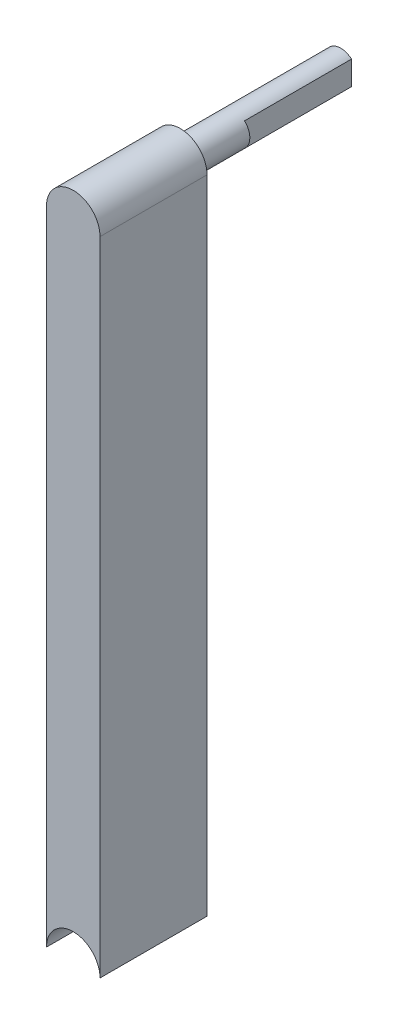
from build123d import *

# Parameters (mm, degrees)
BASE_EXTRUSION_DEPTH    = 20
ESQUISSE2_W             = 3
ESQUISSE2_H             = 30
ENL_V_MAT_EXTRU_1_DEPTH = 20


with BuildPart() as part:
    # Esquisse1 → Base-Extrusion (new body)
    with BuildSketch(Plane.XY):
        with BuildLine():
            Line((5, 120), (5, 0))
            ThreePointArc((5, 0), (0, 5), (-5, 0))
            Line((-5, 0), (-5, 120))
            ThreePointArc((-5, 120), (0, 125), (5, 120))
        make_face()
    extrude(amount=BASE_EXTRUSION_DEPTH)

    # Esquisse2 → Boss.-R_vol.1 (revolve)
    with BuildSketch(Plane(origin=(16.037261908, 117.817006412, 0), x_dir=(-0.9908624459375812, 0.13487628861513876, 0), z_dir=(0.13487628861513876, 0.9908624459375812, 0)), mode=Mode.PRIVATE) as boss_r_vol_1_sk:
        with Locations((17.685154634, -15)):
            Rectangle(ESQUISSE2_W, ESQUISSE2_H)
    revolve(boss_r_vol_1_sk.sketch.rotate(Axis((0, 120, 40.781210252), (0, 0, -1)), 172.248533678), axis=Axis((0, 120, 40.781210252), (0, 0, -1)))

    # Esquisse4 → Enl_v. mat.-Extru.1 (cut)
    with BuildSketch(Plane(origin=(0, 0, -30), x_dir=(-1, 0, 0), z_dir=(0, 0, -1))):
        with BuildLine():
            Line((2, 110.212734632), (2, 129.748731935))
            ThreePointArc((2, 129.748731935), (9.858457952, 119.980733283), (2, 110.212734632))
        make_face()
        with BuildLine():
            Line((-2, 129.806522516), (-2, 110.154944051))
            ThreePointArc((-2, 110.154944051), (-10.141542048, 119.980733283), (-2, 129.806522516))
        make_face()
    extrude(amount=-ENL_V_MAT_EXTRU_1_DEPTH, mode=Mode.SUBTRACT)


solid = part.part
